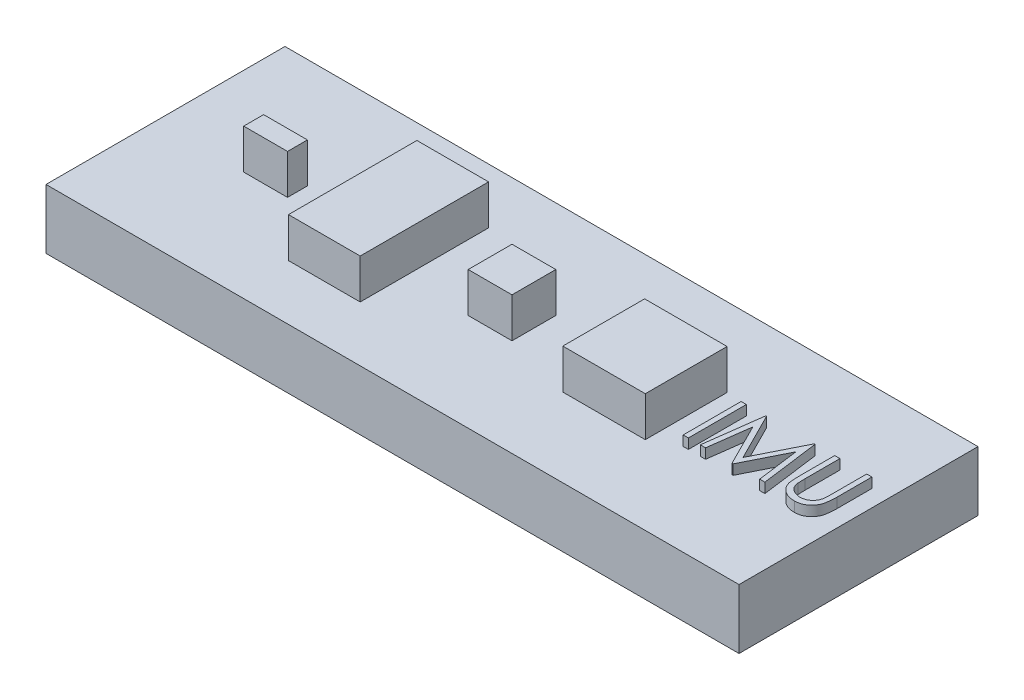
from build123d import *

# Parameters (mm, degrees)
SKETCH1_W           = 34.8
SKETCH1_H           = 12
BOSS_EXTRUDE2_DEPTH = 3
SKETCH4_W           = 4.1418452
SKETCH4_H           = 4.107307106
SKETCH4_W_2         = 2.2
SKETCH4_H_2         = 2.2
SKETCH4_W_3         = 3.601604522
SKETCH4_H_3         = 6.448350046
SKETCH4_H_4         = 1
BOSS_EXTRUDE3_DEPTH = 2
SKETCH5_W           = 0.261191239
SKETCH5_H           = 2.910416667
BOSS_EXTRUDE4_DEPTH = 0.5


with BuildPart() as part:
    # Sketch1 → Boss-Extrude2 (new body)
    with BuildSketch(Plane(origin=(0, 0, 0), x_dir=(1, 0, 0), z_dir=(0, 1, 0))):
        with Locations((17.4, 6)):
            Rectangle(SKETCH1_W, SKETCH1_H)
    extrude(amount=BOSS_EXTRUDE2_DEPTH)

    # Sketch4 → Boss-Extrude3 (add)
    with BuildSketch(Plane(origin=(0, 3, 0), x_dir=(1, 0, 0), z_dir=(0, 1, 0))):
        with Locations((24.075960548, 6)):
            Rectangle(SKETCH4_W, SKETCH4_H)
        with Locations((17.4, 6)):
            Rectangle(SKETCH4_W_2, SKETCH4_H_2)
        with Locations((11.200224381, 6)):
            Rectangle(SKETCH4_W_3, SKETCH4_H_3)
        with Locations((5.527697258, 6)):
            Rectangle(SKETCH4_W_2, SKETCH4_H_4)
    extrude(amount=BOSS_EXTRUDE3_DEPTH)

    # Sketch5 → Boss-Extrude4 (add)
    with BuildSketch(Plane(origin=(0, 3, 0), x_dir=(1, 0, 0), z_dir=(0, 1, 0))):
        with Locations((27.522291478, 6.059068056)):
            Rectangle(SKETCH5_W, SKETCH5_H)
        Polygon((28.249895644, 4.603859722), (28.634103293, 7.514276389), (28.671416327, 7.514276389), (29.873012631, 5.126242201), (31.071693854, 7.514276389), (31.109589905, 7.514276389), (31.496129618, 4.603859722), (31.233772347, 4.603859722), (30.955090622, 6.698053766), (29.904495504, 4.603859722), (29.845610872, 4.603859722), (28.79093464, 6.702717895), (28.512835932, 4.603859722), align=None)
        with BuildLine():
            Line((32.093138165, 7.514276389), (32.354329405, 7.514276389))
            Line((32.354329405, 7.514276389), (32.354329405, 5.770475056))
            add(Edge.make_bspline(
                [(32.354329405, 5.770475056), (32.354290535, 5.745794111), (32.354216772, 5.698957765), (32.354709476, 5.632294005), (32.35608932, 5.573027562), (32.356959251, 5.520929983), (32.35889454, 5.476240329), (32.360472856, 5.438716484), (32.362502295, 5.408536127), (32.364941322, 5.390923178), (32.365989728, 5.383352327)],
                knots=[0, 0, 0, 0, 1.528628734, 2.90083645, 4.128790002, 5.200304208, 6.127813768, 6.898992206, 7.526736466, 8, 8, 8, 8], degree=3))
            add(Edge.make_bspline(
                [(32.365989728, 5.383352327), (32.370295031, 5.356038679), (32.37866305, 5.30295041), (32.399989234, 5.227355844), (32.429773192, 5.159225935), (32.465066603, 5.096434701), (32.511577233, 5.040729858), (32.567293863, 4.98941368), (32.634797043, 4.944533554), (32.709853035, 4.903496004), (32.790750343, 4.870512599), (32.873415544, 4.845571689), (32.956606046, 4.830371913), (33.012299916, 4.82861191), (33.039956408, 4.827737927)],
                knots=[0, 0, 0, 0, 1.035780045, 2.013197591, 2.933192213, 3.817615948, 4.702609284, 5.640816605, 6.646850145, 7.73207398, 8.84249596, 9.914020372, 10.964143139, 12, 12, 12, 12], degree=3))
            add(Edge.make_bspline(
                [(33.039956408, 4.827737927), (33.063700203, 4.828630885), (33.111050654, 4.830411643), (33.18140493, 4.841439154), (33.249924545, 4.861313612), (33.316947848, 4.88695834), (33.379772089, 4.920841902), (33.43843232, 4.959983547), (33.49078983, 5.005894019), (33.538568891, 5.056701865), (33.580175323, 5.114028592), (33.616240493, 5.176625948), (33.645781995, 5.245435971), (33.660370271, 5.293794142), (33.667864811, 5.318637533)],
                knots=[0, 0, 0, 0, 0.994687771, 1.983630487, 2.973142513, 3.978332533, 4.983357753, 5.956394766, 6.925816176, 7.893390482, 8.871859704, 9.88551698, 10.913711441, 12, 12, 12, 12], degree=3))
            add(Edge.make_bspline(
                [(33.667864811, 5.318637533), (33.670359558, 5.328905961), (33.67591886, 5.351788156), (33.681113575, 5.390472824), (33.686524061, 5.436115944), (33.690278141, 5.489045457), (33.693937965, 5.549084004), (33.696127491, 5.61654435), (33.697139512, 5.691181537), (33.697441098, 5.74326732), (33.697598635, 5.770475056)],
                knots=[0, 0, 0, 0, 0.558680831, 1.244966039, 2.062412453, 2.990489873, 4.051219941, 5.244515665, 6.560634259, 8, 8, 8, 8], degree=3))
            Line((33.697598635, 5.770475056), (33.697598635, 7.514276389))
            Line((33.697598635, 7.514276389), (33.958789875, 7.514276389))
            Line((33.958789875, 7.514276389), (33.958789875, 5.756482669))
            add(Edge.make_bspline(
                [(33.958789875, 5.756482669), (33.958578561, 5.724802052), (33.958166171, 5.662975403), (33.954590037, 5.57237716), (33.948888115, 5.486434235), (33.940832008, 5.405135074), (33.930157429, 5.328770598), (33.918286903, 5.256671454), (33.903169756, 5.189355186), (33.885513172, 5.12629692), (33.865328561, 5.066271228), (33.839183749, 5.009303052), (33.80972659, 4.953660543), (33.774789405, 4.900185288), (33.735530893, 4.848640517), (33.691083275, 4.799338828), (33.642916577, 4.751492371), (33.590230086, 4.70632847), (33.533892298, 4.664910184), (33.474070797, 4.628490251), (33.411225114, 4.59770335), (33.345518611, 4.572361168), (33.276923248, 4.553306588), (33.205437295, 4.539107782), (33.130898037, 4.53103986), (33.080203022, 4.529840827), (33.054531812, 4.529233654)],
                knots=[0, 0, 0, 0, 1.316592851, 2.569410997, 3.76748051, 4.895814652, 5.963796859, 6.97159953, 7.931736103, 8.829262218, 9.692595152, 10.560224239, 11.431080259, 12.30701507, 13.211635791, 14.121146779, 15.063487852, 16.031507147, 17.00238618, 17.966455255, 18.938106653, 19.907068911, 20.888905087, 21.893141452, 22.933117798, 24, 24, 24, 24], degree=3))
            add(Edge.make_bspline(
                [(33.054531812, 4.529233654), (33.02653435, 4.529886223), (32.971603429, 4.531166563), (32.890662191, 4.538503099), (32.813066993, 4.552322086), (32.737998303, 4.569917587), (32.666478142, 4.594185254), (32.597548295, 4.622539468), (32.532389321, 4.657362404), (32.469944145, 4.696107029), (32.411881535, 4.739700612), (32.358581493, 4.787215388), (32.309956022, 4.837890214), (32.266824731, 4.892273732), (32.228473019, 4.949942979), (32.195435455, 5.011061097), (32.167068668, 5.075604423), (32.152427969, 5.120469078), (32.145026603, 5.143149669)],
                knots=[0, 0, 0, 0, 1.13879206, 2.234305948, 3.301075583, 4.341971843, 5.366689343, 6.369221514, 7.369726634, 8.367512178, 9.355451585, 10.318319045, 11.268648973, 12.207971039, 13.137398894, 14.081662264, 15.030215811, 16, 16, 16, 16], degree=3))
            add(Edge.make_bspline(
                [(32.145026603, 5.143149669), (32.14072155, 5.158643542), (32.131383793, 5.192250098), (32.121384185, 5.247869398), (32.112978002, 5.311910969), (32.105073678, 5.384379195), (32.100409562, 5.465330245), (32.096320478, 5.554729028), (32.093109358, 5.652683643), (32.093128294, 5.72091588), (32.093138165, 5.756482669)],
                knots=[0, 0, 0, 0, 0.625038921, 1.35572334, 2.194682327, 3.136881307, 4.189498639, 5.346923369, 6.617055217, 8, 8, 8, 8], degree=3))
            Line((32.093138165, 5.756482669), (32.093138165, 7.514276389))
        make_face()
    extrude(amount=BOSS_EXTRUDE4_DEPTH)


solid = part.part
